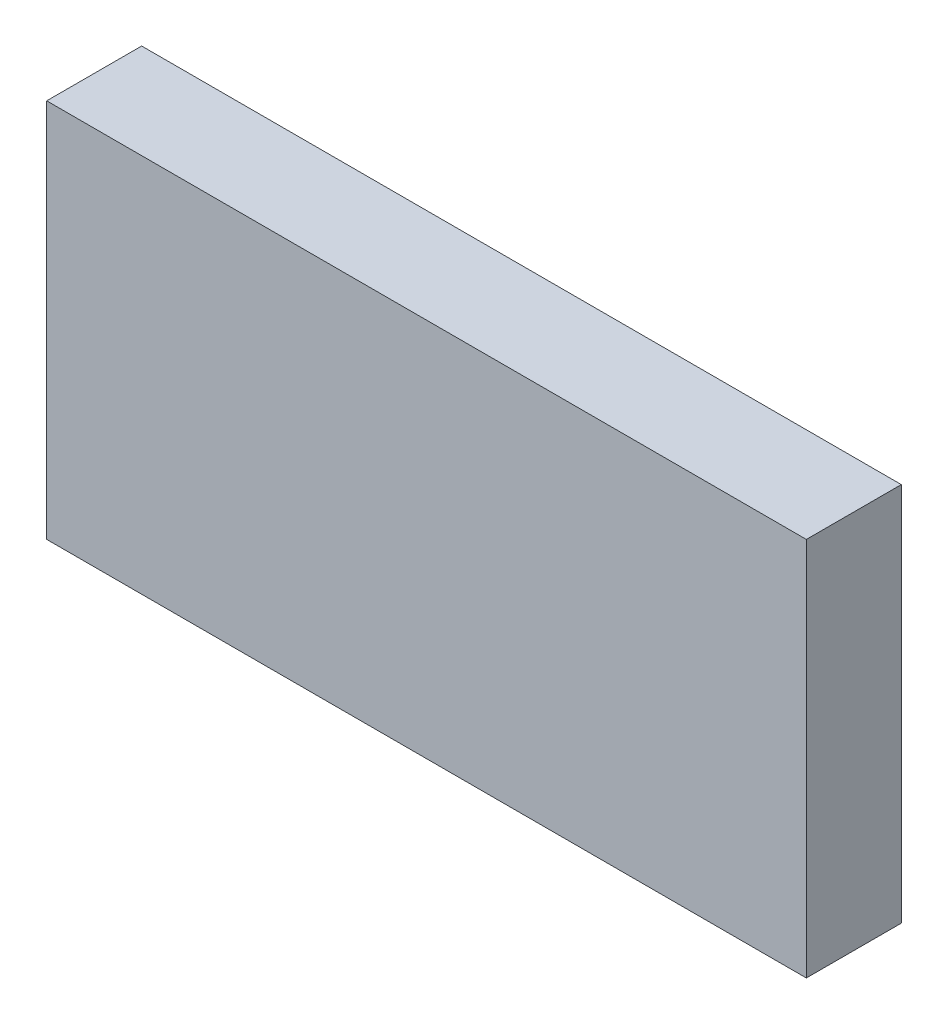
ISO-10303-21;
HEADER;
FILE_DESCRIPTION(('STEP AP214'),'2;1');
FILE_NAME('part.step','',(''),(''),'','','');
FILE_SCHEMA(('AUTOMOTIVE_DESIGN { 1 0 10303 214 1 1 1 1 }'));
ENDSEC;
DATA;
#1=APPLICATION_CONTEXT('core data for automotive mechanical design processes');
#2=APPLICATION_PROTOCOL_DEFINITION('international standard','automotive_design',2000,#1);
#3=PRODUCT_CONTEXT('',#1,'mechanical');
#4=PRODUCT('Part','Part','',(#3));
#5=PRODUCT_RELATED_PRODUCT_CATEGORY('part','',(#4));
#6=PRODUCT_DEFINITION_FORMATION('','',#4);
#7=PRODUCT_DEFINITION_CONTEXT('part definition',#1,'design');
#8=PRODUCT_DEFINITION('design','',#6,#7);
#9=PRODUCT_DEFINITION_SHAPE('','',#8);
#10=(LENGTH_UNIT() NAMED_UNIT(*) SI_UNIT(.MILLI.,.METRE.));
#11=(NAMED_UNIT(*) PLANE_ANGLE_UNIT() SI_UNIT($,.RADIAN.));
#12=(NAMED_UNIT(*) SI_UNIT($,.STERADIAN.) SOLID_ANGLE_UNIT());
#13=UNCERTAINTY_MEASURE_WITH_UNIT(LENGTH_MEASURE(1.E-05),#10,'distance_accuracy_value','');
#14=(GEOMETRIC_REPRESENTATION_CONTEXT(3) GLOBAL_UNCERTAINTY_ASSIGNED_CONTEXT((#13)) GLOBAL_UNIT_ASSIGNED_CONTEXT((#10,
#11,#12)) REPRESENTATION_CONTEXT('',''));
#15=CARTESIAN_POINT('',(0.,0.,0.));
#16=DIRECTION('',(0.,0.,1.));
#17=DIRECTION('',(1.,0.,0.));
#18=AXIS2_PLACEMENT_3D('',#15,#16,#17);
#19=CARTESIAN_POINT('',(-25.4,-12.7,6.35));
#20=DIRECTION('',(1.,0.,0.));
#21=DIRECTION('',(0.,0.,-1.));
#22=AXIS2_PLACEMENT_3D('',#19,#20,#21);
#23=PLANE('',#22);
#24=DIRECTION('',(0.,-1.,0.));
#25=VECTOR('',#24,1.);
#26=CARTESIAN_POINT('',(-25.4,-12.7,0.));
#27=LINE('',#26,#25);
#28=CARTESIAN_POINT('',(-25.4,12.7,0.));
#29=VERTEX_POINT('',#28);
#30=CARTESIAN_POINT('',(-25.4,-12.7,0.));
#31=VERTEX_POINT('',#30);
#32=EDGE_CURVE('E94',#29,#31,#27,.T.);
#33=ORIENTED_EDGE('',*,*,#32,.T.);
#34=DIRECTION('',(0.,0.,-1.));
#35=VECTOR('',#34,1.);
#36=CARTESIAN_POINT('',(-25.4,-12.7,6.35));
#37=LINE('',#36,#35);
#38=CARTESIAN_POINT('',(-25.4,-12.7,6.35));
#39=VERTEX_POINT('',#38);
#40=EDGE_CURVE('E11',#39,#31,#37,.T.);
#41=ORIENTED_EDGE('',*,*,#40,.F.);
#42=DIRECTION('',(0.,-1.,0.));
#43=VECTOR('',#42,1.);
#44=CARTESIAN_POINT('',(-25.4,-12.7,6.35));
#45=LINE('',#44,#43);
#46=CARTESIAN_POINT('',(-25.4,12.7,6.35));
#47=VERTEX_POINT('',#46);
#48=EDGE_CURVE('E82',#47,#39,#45,.T.);
#49=ORIENTED_EDGE('',*,*,#48,.F.);
#50=DIRECTION('',(0.,0.,-1.));
#51=VECTOR('',#50,1.);
#52=CARTESIAN_POINT('',(-25.4,12.7,6.35));
#53=LINE('',#52,#51);
#54=EDGE_CURVE('E90',#47,#29,#53,.T.);
#55=ORIENTED_EDGE('',*,*,#54,.T.);
#56=EDGE_LOOP('',(#33,#41,#49,#55));
#57=FACE_BOUND('',#56,.T.);
#58=ADVANCED_FACE('F31',(#57),#23,.F.);
#59=CARTESIAN_POINT('',(-25.4,-12.7,6.35));
#60=DIRECTION('',(0.,1.,0.));
#61=DIRECTION('',(0.,0.,1.));
#62=AXIS2_PLACEMENT_3D('',#59,#60,#61);
#63=PLANE('',#62);
#64=DIRECTION('',(1.,0.,0.));
#65=VECTOR('',#64,1.);
#66=CARTESIAN_POINT('',(-25.4,-12.7,0.));
#67=LINE('',#66,#65);
#68=CARTESIAN_POINT('',(25.4,-12.7,0.));
#69=VERTEX_POINT('',#68);
#70=EDGE_CURVE('E86',#31,#69,#67,.T.);
#71=ORIENTED_EDGE('',*,*,#70,.T.);
#72=DIRECTION('',(0.,0.,-1.));
#73=VECTOR('',#72,1.);
#74=CARTESIAN_POINT('',(25.4,-12.7,6.35));
#75=LINE('',#74,#73);
#76=CARTESIAN_POINT('',(25.4,-12.7,6.35));
#77=VERTEX_POINT('',#76);
#78=EDGE_CURVE('E39',#77,#69,#75,.T.);
#79=ORIENTED_EDGE('',*,*,#78,.F.);
#80=DIRECTION('',(1.,0.,0.));
#81=VECTOR('',#80,1.);
#82=CARTESIAN_POINT('',(-25.4,-12.7,6.35));
#83=LINE('',#82,#81);
#84=EDGE_CURVE('E77',#39,#77,#83,.T.);
#85=ORIENTED_EDGE('',*,*,#84,.F.);
#86=ORIENTED_EDGE('',*,*,#40,.T.);
#87=EDGE_LOOP('',(#71,#79,#85,#86));
#88=FACE_BOUND('',#87,.T.);
#89=ADVANCED_FACE('F85',(#88),#63,.F.);
#90=CARTESIAN_POINT('',(25.4,-12.7,6.35));
#91=DIRECTION('',(-1.,0.,0.));
#92=DIRECTION('',(0.,0.,1.));
#93=AXIS2_PLACEMENT_3D('',#90,#91,#92);
#94=PLANE('',#93);
#95=DIRECTION('',(0.,1.,0.));
#96=VECTOR('',#95,1.);
#97=CARTESIAN_POINT('',(25.4,-12.7,0.));
#98=LINE('',#97,#96);
#99=CARTESIAN_POINT('',(25.4,12.7,0.));
#100=VERTEX_POINT('',#99);
#101=EDGE_CURVE('E64',#69,#100,#98,.T.);
#102=ORIENTED_EDGE('',*,*,#101,.T.);
#103=DIRECTION('',(0.,0.,-1.));
#104=VECTOR('',#103,1.);
#105=CARTESIAN_POINT('',(25.4,12.7,6.35));
#106=LINE('',#105,#104);
#107=CARTESIAN_POINT('',(25.4,12.7,6.35));
#108=VERTEX_POINT('',#107);
#109=EDGE_CURVE('E87',#108,#100,#106,.T.);
#110=ORIENTED_EDGE('',*,*,#109,.F.);
#111=DIRECTION('',(0.,1.,0.));
#112=VECTOR('',#111,1.);
#113=CARTESIAN_POINT('',(25.4,-12.7,6.35));
#114=LINE('',#113,#112);
#115=EDGE_CURVE('E80',#77,#108,#114,.T.);
#116=ORIENTED_EDGE('',*,*,#115,.F.);
#117=ORIENTED_EDGE('',*,*,#78,.T.);
#118=EDGE_LOOP('',(#102,#110,#116,#117));
#119=FACE_BOUND('',#118,.T.);
#120=ADVANCED_FACE('F88',(#119),#94,.F.);
#121=CARTESIAN_POINT('',(-25.4,12.7,6.35));
#122=DIRECTION('',(0.,-1.,0.));
#123=DIRECTION('',(0.,0.,-1.));
#124=AXIS2_PLACEMENT_3D('',#121,#122,#123);
#125=PLANE('',#124);
#126=DIRECTION('',(-1.,0.,0.));
#127=VECTOR('',#126,1.);
#128=CARTESIAN_POINT('',(-25.4,12.7,0.));
#129=LINE('',#128,#127);
#130=EDGE_CURVE('E70',#100,#29,#129,.T.);
#131=ORIENTED_EDGE('',*,*,#130,.T.);
#132=ORIENTED_EDGE('',*,*,#54,.F.);
#133=DIRECTION('',(-1.,0.,0.));
#134=VECTOR('',#133,1.);
#135=CARTESIAN_POINT('',(-25.4,12.7,6.35));
#136=LINE('',#135,#134);
#137=EDGE_CURVE('E47',#108,#47,#136,.T.);
#138=ORIENTED_EDGE('',*,*,#137,.F.);
#139=ORIENTED_EDGE('',*,*,#109,.T.);
#140=EDGE_LOOP('',(#131,#132,#138,#139));
#141=FACE_BOUND('',#140,.T.);
#142=ADVANCED_FACE('F101',(#141),#125,.F.);
#143=CARTESIAN_POINT('',(-25.4,12.7,6.35));
#144=DIRECTION('',(0.,0.,-1.));
#145=DIRECTION('',(-1.,0.,0.));
#146=AXIS2_PLACEMENT_3D('',#143,#144,#145);
#147=PLANE('',#146);
#148=ORIENTED_EDGE('',*,*,#48,.T.);
#149=ORIENTED_EDGE('',*,*,#84,.T.);
#150=ORIENTED_EDGE('',*,*,#115,.T.);
#151=ORIENTED_EDGE('',*,*,#137,.T.);
#152=EDGE_LOOP('',(#148,#149,#150,#151));
#153=FACE_BOUND('',#152,.T.);
#154=ADVANCED_FACE('F78',(#153),#147,.F.);
#155=CARTESIAN_POINT('',(-25.4,12.7,0.));
#156=DIRECTION('',(0.,0.,-1.));
#157=DIRECTION('',(-1.,0.,0.));
#158=AXIS2_PLACEMENT_3D('',#155,#156,#157);
#159=PLANE('',#158);
#160=ORIENTED_EDGE('',*,*,#32,.F.);
#161=ORIENTED_EDGE('',*,*,#130,.F.);
#162=ORIENTED_EDGE('',*,*,#101,.F.);
#163=ORIENTED_EDGE('',*,*,#70,.F.);
#164=EDGE_LOOP('',(#160,#161,#162,#163));
#165=FACE_BOUND('',#164,.T.);
#166=ADVANCED_FACE('F104',(#165),#159,.T.);
#167=CLOSED_SHELL('',(#58,#89,#120,#142,#154,#166));
#168=MANIFOLD_SOLID_BREP('B2',#167);
#169=ADVANCED_BREP_SHAPE_REPRESENTATION('',(#18,#168),#14);
#170=SHAPE_DEFINITION_REPRESENTATION(#9,#169);
ENDSEC;
END-ISO-10303-21;
